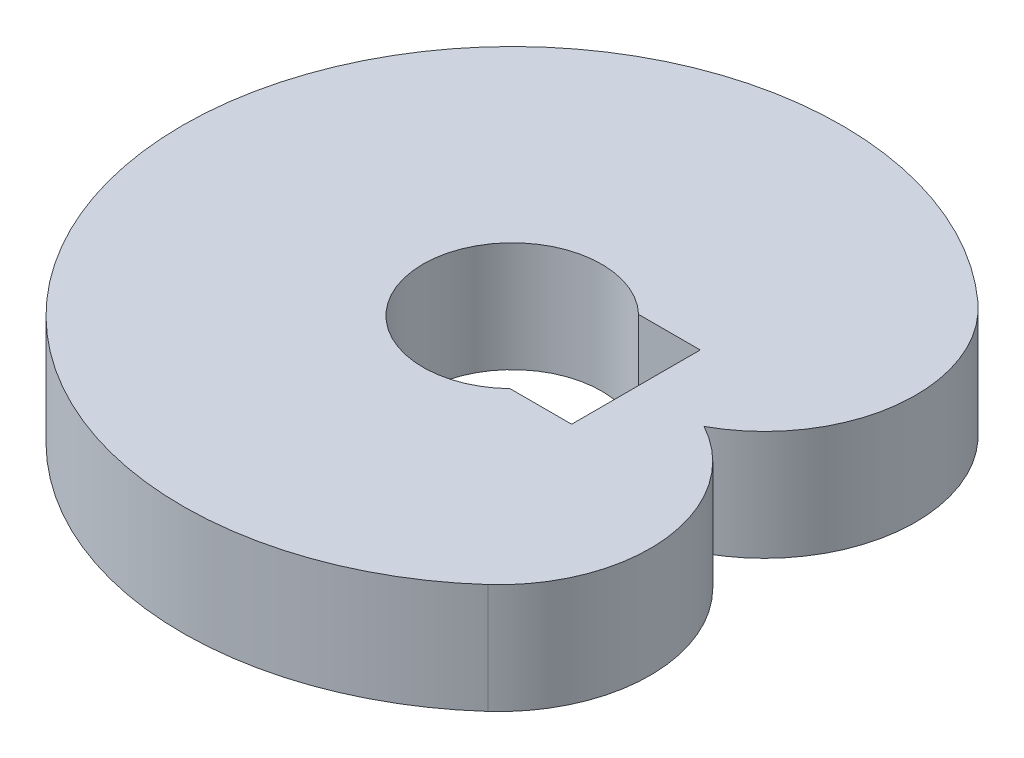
ISO-10303-21;
HEADER;
FILE_DESCRIPTION(('STEP AP214'),'2;1');
FILE_NAME('part.step','',(''),(''),'','','');
FILE_SCHEMA(('AUTOMOTIVE_DESIGN { 1 0 10303 214 1 1 1 1 }'));
ENDSEC;
DATA;
#1=APPLICATION_CONTEXT('core data for automotive mechanical design processes');
#2=APPLICATION_PROTOCOL_DEFINITION('international standard','automotive_design',2000,#1);
#3=PRODUCT_CONTEXT('',#1,'mechanical');
#4=PRODUCT('Part','Part','',(#3));
#5=PRODUCT_RELATED_PRODUCT_CATEGORY('part','',(#4));
#6=PRODUCT_DEFINITION_FORMATION('','',#4);
#7=PRODUCT_DEFINITION_CONTEXT('part definition',#1,'design');
#8=PRODUCT_DEFINITION('design','',#6,#7);
#9=PRODUCT_DEFINITION_SHAPE('','',#8);
#10=(LENGTH_UNIT() NAMED_UNIT(*) SI_UNIT(.MILLI.,.METRE.));
#11=(NAMED_UNIT(*) PLANE_ANGLE_UNIT() SI_UNIT($,.RADIAN.));
#12=(NAMED_UNIT(*) SI_UNIT($,.STERADIAN.) SOLID_ANGLE_UNIT());
#13=UNCERTAINTY_MEASURE_WITH_UNIT(LENGTH_MEASURE(1.E-05),#10,'distance_accuracy_value','');
#14=(GEOMETRIC_REPRESENTATION_CONTEXT(3) GLOBAL_UNCERTAINTY_ASSIGNED_CONTEXT((#13)) GLOBAL_UNIT_ASSIGNED_CONTEXT((#10,
#11,#12)) REPRESENTATION_CONTEXT('',''));
#15=CARTESIAN_POINT('',(0.,0.,0.));
#16=DIRECTION('',(0.,0.,1.));
#17=DIRECTION('',(1.,0.,0.));
#18=AXIS2_PLACEMENT_3D('',#15,#16,#17);
#19=CARTESIAN_POINT('',(87.430047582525,0.,117.000000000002));
#20=DIRECTION('',(0.,0.,1.));
#21=DIRECTION('',(1.,0.,0.));
#22=AXIS2_PLACEMENT_3D('',#19,#20,#21);
#23=PLANE('',#22);
#24=DIRECTION('',(0.,1.,0.));
#25=VECTOR('',#24,1.);
#26=CARTESIAN_POINT('',(112.914835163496,200.,117.000000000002));
#27=LINE('',#26,#25);
#28=CARTESIAN_POINT('',(112.914835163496,0.,117.000000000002));
#29=VERTEX_POINT('',#28);
#30=CARTESIAN_POINT('',(112.914835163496,200.,117.000000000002));
#31=VERTEX_POINT('',#30);
#32=EDGE_CURVE('E117',#29,#31,#27,.T.);
#33=ORIENTED_EDGE('',*,*,#32,.T.);
#34=DIRECTION('',(1.,0.,0.));
#35=VECTOR('',#34,1.);
#36=CARTESIAN_POINT('',(87.430047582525,200.,117.000000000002));
#37=LINE('',#36,#35);
#38=CARTESIAN_POINT('',(225.,200.,117.000000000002));
#39=VERTEX_POINT('',#38);
#40=EDGE_CURVE('E126',#31,#39,#37,.T.);
#41=ORIENTED_EDGE('',*,*,#40,.T.);
#42=DIRECTION('',(0.,1.,0.));
#43=VECTOR('',#42,1.);
#44=CARTESIAN_POINT('',(225.,0.,117.000000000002));
#45=LINE('',#44,#43);
#46=CARTESIAN_POINT('',(225.,0.,117.000000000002));
#47=VERTEX_POINT('',#46);
#48=EDGE_CURVE('E11',#47,#39,#45,.T.);
#49=ORIENTED_EDGE('',*,*,#48,.F.);
#50=DIRECTION('',(1.,0.,0.));
#51=VECTOR('',#50,1.);
#52=CARTESIAN_POINT('',(0.,0.,117.000000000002));
#53=LINE('',#52,#51);
#54=EDGE_CURVE('E115',#29,#47,#53,.T.);
#55=ORIENTED_EDGE('',*,*,#54,.F.);
#56=EDGE_LOOP('',(#33,#41,#49,#55));
#57=FACE_BOUND('',#56,.T.);
#58=ADVANCED_FACE('F16',(#57),#23,.F.);
#59=CARTESIAN_POINT('',(225.,0.,-117.000000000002));
#60=DIRECTION('',(1.,0.,0.));
#61=DIRECTION('',(0.,1.,0.));
#62=AXIS2_PLACEMENT_3D('',#59,#60,#61);
#63=PLANE('',#62);
#64=DIRECTION('',(0.,0.,-1.));
#65=VECTOR('',#64,1.);
#66=CARTESIAN_POINT('',(225.,200.,-117.000000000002));
#67=LINE('',#66,#65);
#68=CARTESIAN_POINT('',(225.,200.,-117.000000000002));
#69=VERTEX_POINT('',#68);
#70=EDGE_CURVE('E123',#39,#69,#67,.T.);
#71=ORIENTED_EDGE('',*,*,#70,.T.);
#72=DIRECTION('',(0.,1.,0.));
#73=VECTOR('',#72,1.);
#74=CARTESIAN_POINT('',(225.,0.,-117.000000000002));
#75=LINE('',#74,#73);
#76=CARTESIAN_POINT('',(225.,0.,-117.000000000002));
#77=VERTEX_POINT('',#76);
#78=EDGE_CURVE('E26',#77,#69,#75,.T.);
#79=ORIENTED_EDGE('',*,*,#78,.F.);
#80=DIRECTION('',(0.,0.,-1.));
#81=VECTOR('',#80,1.);
#82=CARTESIAN_POINT('',(225.,0.,-117.000000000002));
#83=LINE('',#82,#81);
#84=EDGE_CURVE('E140',#47,#77,#83,.T.);
#85=ORIENTED_EDGE('',*,*,#84,.F.);
#86=ORIENTED_EDGE('',*,*,#48,.T.);
#87=EDGE_LOOP('',(#71,#79,#85,#86));
#88=FACE_BOUND('',#87,.T.);
#89=ADVANCED_FACE('F168',(#88),#63,.F.);
#90=CARTESIAN_POINT('',(87.430047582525,0.,-117.000000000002));
#91=DIRECTION('',(0.,0.,-1.));
#92=DIRECTION('',(0.,-1.,0.));
#93=AXIS2_PLACEMENT_3D('',#90,#91,#92);
#94=PLANE('',#93);
#95=DIRECTION('',(0.,-1.,0.));
#96=VECTOR('',#95,1.);
#97=CARTESIAN_POINT('',(112.914835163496,200.,-117.000000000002));
#98=LINE('',#97,#96);
#99=CARTESIAN_POINT('',(112.914835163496,200.,-117.000000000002));
#100=VERTEX_POINT('',#99);
#101=CARTESIAN_POINT('',(112.914835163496,0.,-117.000000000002));
#102=VERTEX_POINT('',#101);
#103=EDGE_CURVE('E85',#100,#102,#98,.T.);
#104=ORIENTED_EDGE('',*,*,#103,.T.);
#105=DIRECTION('',(-1.,0.,0.));
#106=VECTOR('',#105,1.);
#107=CARTESIAN_POINT('',(87.430047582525,0.,-117.000000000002));
#108=LINE('',#107,#106);
#109=EDGE_CURVE('E113',#77,#102,#108,.T.);
#110=ORIENTED_EDGE('',*,*,#109,.F.);
#111=ORIENTED_EDGE('',*,*,#78,.T.);
#112=DIRECTION('',(-1.,0.,0.));
#113=VECTOR('',#112,1.);
#114=CARTESIAN_POINT('',(87.430047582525,200.,-117.000000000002));
#115=LINE('',#114,#113);
#116=EDGE_CURVE('E19',#69,#100,#115,.T.);
#117=ORIENTED_EDGE('',*,*,#116,.T.);
#118=EDGE_LOOP('',(#104,#110,#111,#117));
#119=FACE_BOUND('',#118,.T.);
#120=ADVANCED_FACE('F162',(#119),#94,.F.);
#121=CARTESIAN_POINT('',(0.,0.,0.));
#122=DIRECTION('',(0.,1.,0.));
#123=DIRECTION('',(1.,0.,0.));
#124=AXIS2_PLACEMENT_3D('',#121,#122,#123);
#125=PLANE('',#124);
#126=ORIENTED_EDGE('',*,*,#84,.T.);
#127=ORIENTED_EDGE('',*,*,#109,.T.);
#128=CARTESIAN_POINT('',(0.,0.,0.));
#129=DIRECTION('',(0.,1.,0.));
#130=DIRECTION('',(0.,0.,1.));
#131=AXIS2_PLACEMENT_3D('',#128,#129,#130);
#132=CIRCLE('',#131,162.6);
#133=EDGE_CURVE('E121',#102,#29,#132,.T.);
#134=ORIENTED_EDGE('',*,*,#133,.T.);
#135=ORIENTED_EDGE('',*,*,#54,.T.);
#136=EDGE_LOOP('',(#126,#127,#134,#135));
#137=FACE_BOUND('',#136,.T.);
#138=CARTESIAN_POINT('',(217.46744706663,0.,241.522068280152));
#139=DIRECTION('',(0.,1.,0.));
#140=DIRECTION('',(0.,0.,1.));
#141=AXIS2_PLACEMENT_3D('',#138,#139,#140);
#142=CIRCLE('',#141,275.);
#143=CARTESIAN_POINT('',(401.478363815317,0.,445.886895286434));
#144=VERTEX_POINT('',#143);
#145=CARTESIAN_POINT('',(348.966840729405,0.,-1.38777878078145E-13));
#146=VERTEX_POINT('',#145);
#147=EDGE_CURVE('E109',#144,#146,#142,.T.);
#148=ORIENTED_EDGE('',*,*,#147,.F.);
#149=CARTESIAN_POINT('',(0.,0.,0.));
#150=DIRECTION('',(0.,1.,0.));
#151=DIRECTION('',(0.,0.,1.));
#152=AXIS2_PLACEMENT_3D('',#149,#150,#151);
#153=CIRCLE('',#152,600.);
#154=CARTESIAN_POINT('',(401.478363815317,0.,-445.886895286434));
#155=VERTEX_POINT('',#154);
#156=EDGE_CURVE('E86',#155,#144,#153,.T.);
#157=ORIENTED_EDGE('',*,*,#156,.F.);
#158=CARTESIAN_POINT('',(217.46744706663,0.,-241.522068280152));
#159=DIRECTION('',(0.,1.,0.));
#160=DIRECTION('',(0.,0.,1.));
#161=AXIS2_PLACEMENT_3D('',#158,#159,#160);
#162=CIRCLE('',#161,275.);
#163=EDGE_CURVE('E97',#146,#155,#162,.T.);
#164=ORIENTED_EDGE('',*,*,#163,.F.);
#165=EDGE_LOOP('',(#148,#157,#164));
#166=FACE_BOUND('',#165,.T.);
#167=ADVANCED_FACE('F167',(#137,#166),#125,.F.);
#168=CARTESIAN_POINT('',(0.,200.,0.));
#169=DIRECTION('',(0.,1.,0.));
#170=DIRECTION('',(1.,0.,0.));
#171=AXIS2_PLACEMENT_3D('',#168,#169,#170);
#172=PLANE('',#171);
#173=ORIENTED_EDGE('',*,*,#116,.F.);
#174=ORIENTED_EDGE('',*,*,#70,.F.);
#175=ORIENTED_EDGE('',*,*,#40,.F.);
#176=CARTESIAN_POINT('',(0.,200.,0.));
#177=DIRECTION('',(0.,1.,0.));
#178=DIRECTION('',(0.,0.,1.));
#179=AXIS2_PLACEMENT_3D('',#176,#177,#178);
#180=CIRCLE('',#179,162.6);
#181=EDGE_CURVE('E122',#100,#31,#180,.T.);
#182=ORIENTED_EDGE('',*,*,#181,.F.);
#183=EDGE_LOOP('',(#173,#174,#175,#182));
#184=FACE_BOUND('',#183,.T.);
#185=CARTESIAN_POINT('',(217.46744706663,200.,241.522068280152));
#186=DIRECTION('',(0.,1.,0.));
#187=DIRECTION('',(0.,0.,1.));
#188=AXIS2_PLACEMENT_3D('',#185,#186,#187);
#189=CIRCLE('',#188,275.);
#190=CARTESIAN_POINT('',(401.478363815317,200.,445.886895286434));
#191=VERTEX_POINT('',#190);
#192=CARTESIAN_POINT('',(348.966840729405,200.,-1.38777878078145E-13));
#193=VERTEX_POINT('',#192);
#194=EDGE_CURVE('E78',#191,#193,#189,.T.);
#195=ORIENTED_EDGE('',*,*,#194,.T.);
#196=CARTESIAN_POINT('',(217.46744706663,200.,-241.522068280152));
#197=DIRECTION('',(0.,1.,0.));
#198=DIRECTION('',(0.,0.,1.));
#199=AXIS2_PLACEMENT_3D('',#196,#197,#198);
#200=CIRCLE('',#199,275.);
#201=CARTESIAN_POINT('',(401.478363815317,200.,-445.886895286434));
#202=VERTEX_POINT('',#201);
#203=EDGE_CURVE('E80',#193,#202,#200,.T.);
#204=ORIENTED_EDGE('',*,*,#203,.T.);
#205=CARTESIAN_POINT('',(0.,200.,0.));
#206=DIRECTION('',(0.,1.,0.));
#207=DIRECTION('',(0.,0.,1.));
#208=AXIS2_PLACEMENT_3D('',#205,#206,#207);
#209=CIRCLE('',#208,600.);
#210=EDGE_CURVE('E74',#202,#191,#209,.T.);
#211=ORIENTED_EDGE('',*,*,#210,.T.);
#212=EDGE_LOOP('',(#195,#204,#211));
#213=FACE_BOUND('',#212,.T.);
#214=ADVANCED_FACE('F76',(#184,#213),#172,.T.);
#215=CARTESIAN_POINT('',(0.,200.,0.));
#216=DIRECTION('',(0.,-1.,0.));
#217=DIRECTION('',(0.,0.,-1.));
#218=AXIS2_PLACEMENT_3D('',#215,#216,#217);
#219=CYLINDRICAL_SURFACE('',#218,162.6);
#220=ORIENTED_EDGE('',*,*,#103,.F.);
#221=ORIENTED_EDGE('',*,*,#181,.T.);
#222=ORIENTED_EDGE('',*,*,#32,.F.);
#223=ORIENTED_EDGE('',*,*,#133,.F.);
#224=EDGE_LOOP('',(#220,#221,#222,#223));
#225=FACE_BOUND('',#224,.T.);
#226=ADVANCED_FACE('F197',(#225),#219,.F.);
#227=CARTESIAN_POINT('',(0.,200.,0.));
#228=DIRECTION('',(0.,-1.,0.));
#229=DIRECTION('',(0.,0.,-1.));
#230=AXIS2_PLACEMENT_3D('',#227,#228,#229);
#231=CYLINDRICAL_SURFACE('',#230,600.);
#232=ORIENTED_EDGE('',*,*,#156,.T.);
#233=DIRECTION('',(0.,-1.,0.));
#234=VECTOR('',#233,1.);
#235=CARTESIAN_POINT('',(401.478363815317,200.,445.886895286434));
#236=LINE('',#235,#234);
#237=EDGE_CURVE('E90',#191,#144,#236,.T.);
#238=ORIENTED_EDGE('',*,*,#237,.F.);
#239=ORIENTED_EDGE('',*,*,#210,.F.);
#240=DIRECTION('',(0.,-1.,0.));
#241=VECTOR('',#240,1.);
#242=CARTESIAN_POINT('',(401.478363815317,200.,-445.886895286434));
#243=LINE('',#242,#241);
#244=EDGE_CURVE('E130',#202,#155,#243,.T.);
#245=ORIENTED_EDGE('',*,*,#244,.T.);
#246=EDGE_LOOP('',(#232,#238,#239,#245));
#247=FACE_BOUND('',#246,.T.);
#248=ADVANCED_FACE('F91',(#247),#231,.T.);
#249=CARTESIAN_POINT('',(217.46744706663,200.,-241.522068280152));
#250=DIRECTION('',(0.,-1.,0.));
#251=DIRECTION('',(0.,0.,-1.));
#252=AXIS2_PLACEMENT_3D('',#249,#250,#251);
#253=CYLINDRICAL_SURFACE('',#252,275.);
#254=ORIENTED_EDGE('',*,*,#163,.T.);
#255=ORIENTED_EDGE('',*,*,#244,.F.);
#256=ORIENTED_EDGE('',*,*,#203,.F.);
#257=DIRECTION('',(0.,-1.,0.));
#258=VECTOR('',#257,1.);
#259=CARTESIAN_POINT('',(348.966840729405,200.,-1.38777878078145E-13));
#260=LINE('',#259,#258);
#261=EDGE_CURVE('E101',#193,#146,#260,.T.);
#262=ORIENTED_EDGE('',*,*,#261,.T.);
#263=EDGE_LOOP('',(#254,#255,#256,#262));
#264=FACE_BOUND('',#263,.T.);
#265=ADVANCED_FACE('F180',(#264),#253,.T.);
#266=CARTESIAN_POINT('',(217.46744706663,200.,241.522068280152));
#267=DIRECTION('',(0.,-1.,0.));
#268=DIRECTION('',(0.,0.,-1.));
#269=AXIS2_PLACEMENT_3D('',#266,#267,#268);
#270=CYLINDRICAL_SURFACE('',#269,275.);
#271=ORIENTED_EDGE('',*,*,#147,.T.);
#272=ORIENTED_EDGE('',*,*,#261,.F.);
#273=ORIENTED_EDGE('',*,*,#194,.F.);
#274=ORIENTED_EDGE('',*,*,#237,.T.);
#275=EDGE_LOOP('',(#271,#272,#273,#274));
#276=FACE_BOUND('',#275,.T.);
#277=ADVANCED_FACE('F99',(#276),#270,.T.);
#278=CLOSED_SHELL('',(#58,#89,#120,#167,#214,#226,#248,#265,#277));
#279=MANIFOLD_SOLID_BREP('B1',#278);
#280=ADVANCED_BREP_SHAPE_REPRESENTATION('',(#18,#279),#14);
#281=SHAPE_DEFINITION_REPRESENTATION(#9,#280);
ENDSEC;
END-ISO-10303-21;
